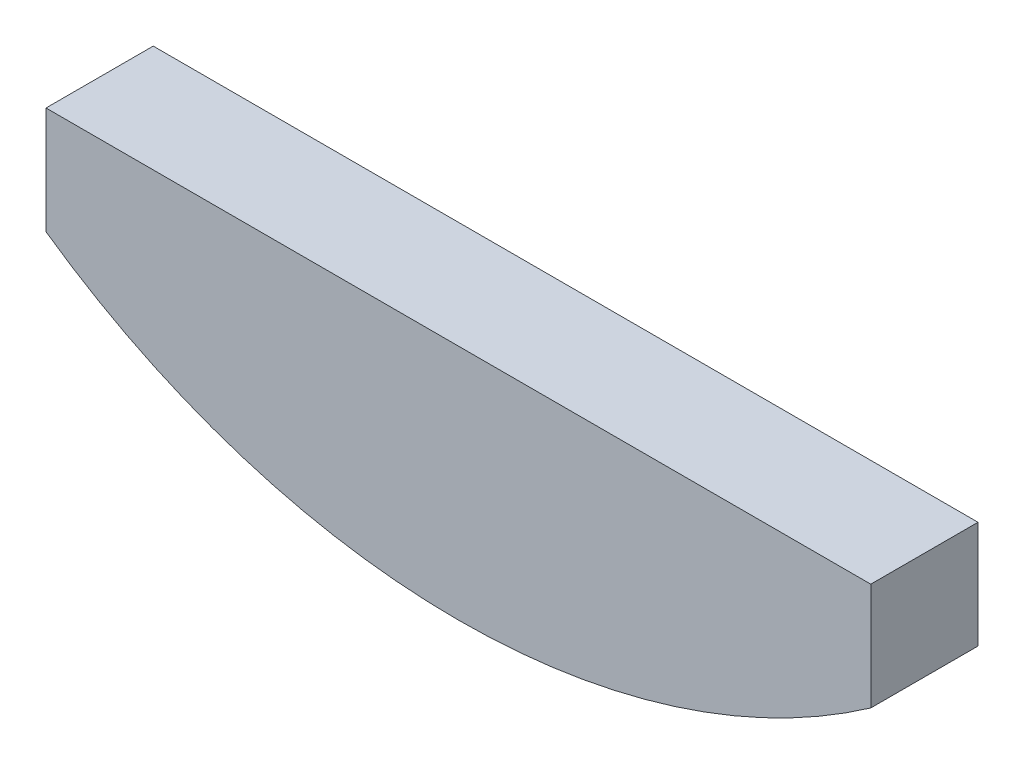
ISO-10303-21;
HEADER;
FILE_DESCRIPTION(('STEP AP214'),'2;1');
FILE_NAME('part.step','',(''),(''),'','','');
FILE_SCHEMA(('AUTOMOTIVE_DESIGN { 1 0 10303 214 1 1 1 1 }'));
ENDSEC;
DATA;
#1=APPLICATION_CONTEXT('core data for automotive mechanical design processes');
#2=APPLICATION_PROTOCOL_DEFINITION('international standard','automotive_design',2000,#1);
#3=PRODUCT_CONTEXT('',#1,'mechanical');
#4=PRODUCT('Part','Part','',(#3));
#5=PRODUCT_RELATED_PRODUCT_CATEGORY('part','',(#4));
#6=PRODUCT_DEFINITION_FORMATION('','',#4);
#7=PRODUCT_DEFINITION_CONTEXT('part definition',#1,'design');
#8=PRODUCT_DEFINITION('design','',#6,#7);
#9=PRODUCT_DEFINITION_SHAPE('','',#8);
#10=(LENGTH_UNIT() NAMED_UNIT(*) SI_UNIT(.MILLI.,.METRE.));
#11=(NAMED_UNIT(*) PLANE_ANGLE_UNIT() SI_UNIT($,.RADIAN.));
#12=(NAMED_UNIT(*) SI_UNIT($,.STERADIAN.) SOLID_ANGLE_UNIT());
#13=UNCERTAINTY_MEASURE_WITH_UNIT(LENGTH_MEASURE(1.E-05),#10,'distance_accuracy_value','');
#14=(GEOMETRIC_REPRESENTATION_CONTEXT(3) GLOBAL_UNCERTAINTY_ASSIGNED_CONTEXT((#13)) GLOBAL_UNIT_ASSIGNED_CONTEXT((#10,
#11,#12)) REPRESENTATION_CONTEXT('',''));
#15=CARTESIAN_POINT('',(0.,0.,0.));
#16=DIRECTION('',(0.,0.,1.));
#17=DIRECTION('',(1.,0.,0.));
#18=AXIS2_PLACEMENT_3D('',#15,#16,#17);
#19=CARTESIAN_POINT('',(-13.0123312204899,27.4827556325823,2.6));
#20=DIRECTION('',(0.,-1.,0.));
#21=DIRECTION('',(0.,0.,-1.));
#22=AXIS2_PLACEMENT_3D('',#19,#20,#21);
#23=PLANE('',#22);
#24=DIRECTION('',(-1.,0.,0.));
#25=VECTOR('',#24,1.);
#26=CARTESIAN_POINT('',(-13.0123312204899,27.4827556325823,0.));
#27=LINE('',#26,#25);
#28=CARTESIAN_POINT('',(6.98766877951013,27.4827556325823,0.));
#29=VERTEX_POINT('',#28);
#30=CARTESIAN_POINT('',(-13.0123312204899,27.4827556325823,0.));
#31=VERTEX_POINT('',#30);
#32=EDGE_CURVE('E96',#29,#31,#27,.T.);
#33=ORIENTED_EDGE('',*,*,#32,.T.);
#34=DIRECTION('',(0.,0.,-1.));
#35=VECTOR('',#34,1.);
#36=CARTESIAN_POINT('',(-13.0123312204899,27.4827556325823,2.6));
#37=LINE('',#36,#35);
#38=CARTESIAN_POINT('',(-13.0123312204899,27.4827556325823,2.6));
#39=VERTEX_POINT('',#38);
#40=EDGE_CURVE('E11',#39,#31,#37,.T.);
#41=ORIENTED_EDGE('',*,*,#40,.F.);
#42=DIRECTION('',(-1.,0.,0.));
#43=VECTOR('',#42,1.);
#44=CARTESIAN_POINT('',(-13.0123312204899,27.4827556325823,2.6));
#45=LINE('',#44,#43);
#46=CARTESIAN_POINT('',(6.98766877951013,27.4827556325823,2.6));
#47=VERTEX_POINT('',#46);
#48=EDGE_CURVE('E84',#47,#39,#45,.T.);
#49=ORIENTED_EDGE('',*,*,#48,.F.);
#50=DIRECTION('',(0.,0.,-1.));
#51=VECTOR('',#50,1.);
#52=CARTESIAN_POINT('',(6.98766877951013,27.4827556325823,2.6));
#53=LINE('',#52,#51);
#54=EDGE_CURVE('E92',#47,#29,#53,.T.);
#55=ORIENTED_EDGE('',*,*,#54,.T.);
#56=EDGE_LOOP('',(#33,#41,#49,#55));
#57=FACE_BOUND('',#56,.T.);
#58=ADVANCED_FACE('F33',(#57),#23,.F.);
#59=CARTESIAN_POINT('',(-13.0123312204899,27.4827556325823,2.6));
#60=DIRECTION('',(1.,0.,0.));
#61=DIRECTION('',(0.,0.,-1.));
#62=AXIS2_PLACEMENT_3D('',#59,#60,#61);
#63=PLANE('',#62);
#64=DIRECTION('',(0.,-1.,0.));
#65=VECTOR('',#64,1.);
#66=CARTESIAN_POINT('',(-13.0123312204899,27.4827556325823,0.));
#67=LINE('',#66,#65);
#68=CARTESIAN_POINT('',(-13.0123312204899,24.8827556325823,0.));
#69=VERTEX_POINT('',#68);
#70=EDGE_CURVE('E88',#31,#69,#67,.T.);
#71=ORIENTED_EDGE('',*,*,#70,.T.);
#72=DIRECTION('',(0.,0.,-1.));
#73=VECTOR('',#72,1.);
#74=CARTESIAN_POINT('',(-13.0123312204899,24.8827556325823,2.6));
#75=LINE('',#74,#73);
#76=CARTESIAN_POINT('',(-13.0123312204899,24.8827556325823,2.6));
#77=VERTEX_POINT('',#76);
#78=EDGE_CURVE('E41',#77,#69,#75,.T.);
#79=ORIENTED_EDGE('',*,*,#78,.F.);
#80=DIRECTION('',(0.,-1.,0.));
#81=VECTOR('',#80,1.);
#82=CARTESIAN_POINT('',(-13.0123312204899,27.4827556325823,2.6));
#83=LINE('',#82,#81);
#84=EDGE_CURVE('E79',#39,#77,#83,.T.);
#85=ORIENTED_EDGE('',*,*,#84,.F.);
#86=ORIENTED_EDGE('',*,*,#40,.T.);
#87=EDGE_LOOP('',(#71,#79,#85,#86));
#88=FACE_BOUND('',#87,.T.);
#89=ADVANCED_FACE('F87',(#88),#63,.F.);
#90=CARTESIAN_POINT('',(-3.01233122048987,39.1555352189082,2.6));
#91=DIRECTION('',(0.,0.,-1.));
#92=DIRECTION('',(-1.,0.,0.));
#93=AXIS2_PLACEMENT_3D('',#90,#91,#92);
#94=CYLINDRICAL_SURFACE('',#93,17.427341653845);
#95=CARTESIAN_POINT('',(-3.01233122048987,39.1555352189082,0.));
#96=DIRECTION('',(0.,0.,1.));
#97=DIRECTION('',(-1.,0.,0.));
#98=AXIS2_PLACEMENT_3D('',#95,#96,#97);
#99=CIRCLE('',#98,17.427341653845);
#100=CARTESIAN_POINT('',(6.98766877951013,24.8827556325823,0.));
#101=VERTEX_POINT('',#100);
#102=EDGE_CURVE('E66',#69,#101,#99,.T.);
#103=ORIENTED_EDGE('',*,*,#102,.T.);
#104=DIRECTION('',(0.,0.,-1.));
#105=VECTOR('',#104,1.);
#106=CARTESIAN_POINT('',(6.98766877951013,24.8827556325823,2.6));
#107=LINE('',#106,#105);
#108=CARTESIAN_POINT('',(6.98766877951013,24.8827556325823,2.6));
#109=VERTEX_POINT('',#108);
#110=EDGE_CURVE('E89',#109,#101,#107,.T.);
#111=ORIENTED_EDGE('',*,*,#110,.F.);
#112=CARTESIAN_POINT('',(-3.01233122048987,39.1555352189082,2.6));
#113=DIRECTION('',(0.,0.,1.));
#114=DIRECTION('',(-1.,0.,0.));
#115=AXIS2_PLACEMENT_3D('',#112,#113,#114);
#116=CIRCLE('',#115,17.427341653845);
#117=EDGE_CURVE('E82',#77,#109,#116,.T.);
#118=ORIENTED_EDGE('',*,*,#117,.F.);
#119=ORIENTED_EDGE('',*,*,#78,.T.);
#120=EDGE_LOOP('',(#103,#111,#118,#119));
#121=FACE_BOUND('',#120,.T.);
#122=ADVANCED_FACE('F90',(#121),#94,.T.);
#123=CARTESIAN_POINT('',(6.98766877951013,27.4827556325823,2.6));
#124=DIRECTION('',(-1.,0.,0.));
#125=DIRECTION('',(0.,0.,1.));
#126=AXIS2_PLACEMENT_3D('',#123,#124,#125);
#127=PLANE('',#126);
#128=DIRECTION('',(0.,1.,0.));
#129=VECTOR('',#128,1.);
#130=CARTESIAN_POINT('',(6.98766877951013,27.4827556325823,0.));
#131=LINE('',#130,#129);
#132=EDGE_CURVE('E72',#101,#29,#131,.T.);
#133=ORIENTED_EDGE('',*,*,#132,.T.);
#134=ORIENTED_EDGE('',*,*,#54,.F.);
#135=DIRECTION('',(0.,1.,0.));
#136=VECTOR('',#135,1.);
#137=CARTESIAN_POINT('',(6.98766877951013,27.4827556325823,2.6));
#138=LINE('',#137,#136);
#139=EDGE_CURVE('E49',#109,#47,#138,.T.);
#140=ORIENTED_EDGE('',*,*,#139,.F.);
#141=ORIENTED_EDGE('',*,*,#110,.T.);
#142=EDGE_LOOP('',(#133,#134,#140,#141));
#143=FACE_BOUND('',#142,.T.);
#144=ADVANCED_FACE('F103',(#143),#127,.F.);
#145=CARTESIAN_POINT('',(-3.01233122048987,39.1555352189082,2.6));
#146=DIRECTION('',(0.,0.,-1.));
#147=DIRECTION('',(-1.,0.,0.));
#148=AXIS2_PLACEMENT_3D('',#145,#146,#147);
#149=PLANE('',#148);
#150=ORIENTED_EDGE('',*,*,#48,.T.);
#151=ORIENTED_EDGE('',*,*,#84,.T.);
#152=ORIENTED_EDGE('',*,*,#117,.T.);
#153=ORIENTED_EDGE('',*,*,#139,.T.);
#154=EDGE_LOOP('',(#150,#151,#152,#153));
#155=FACE_BOUND('',#154,.T.);
#156=ADVANCED_FACE('F80',(#155),#149,.F.);
#157=CARTESIAN_POINT('',(-3.01233122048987,39.1555352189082,0.));
#158=DIRECTION('',(0.,0.,-1.));
#159=DIRECTION('',(-1.,0.,0.));
#160=AXIS2_PLACEMENT_3D('',#157,#158,#159);
#161=PLANE('',#160);
#162=ORIENTED_EDGE('',*,*,#32,.F.);
#163=ORIENTED_EDGE('',*,*,#132,.F.);
#164=ORIENTED_EDGE('',*,*,#102,.F.);
#165=ORIENTED_EDGE('',*,*,#70,.F.);
#166=EDGE_LOOP('',(#162,#163,#164,#165));
#167=FACE_BOUND('',#166,.T.);
#168=ADVANCED_FACE('F106',(#167),#161,.T.);
#169=CLOSED_SHELL('',(#58,#89,#122,#144,#156,#168));
#170=MANIFOLD_SOLID_BREP('B2',#169);
#171=ADVANCED_BREP_SHAPE_REPRESENTATION('',(#18,#170),#14);
#172=SHAPE_DEFINITION_REPRESENTATION(#9,#171);
ENDSEC;
END-ISO-10303-21;
